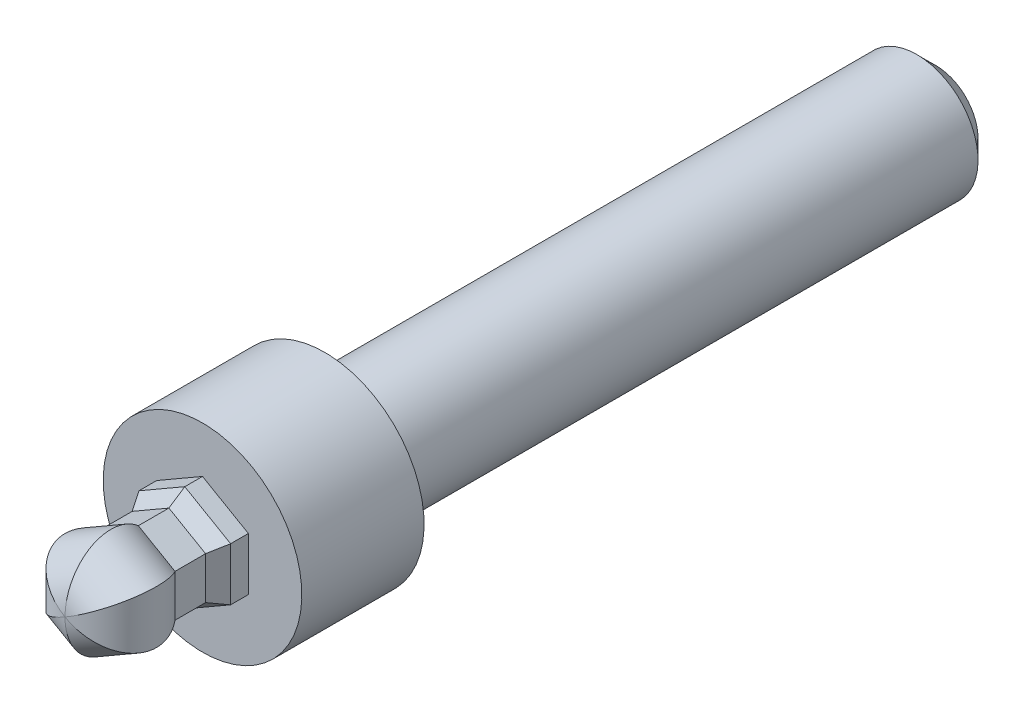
ISO-10303-21;
HEADER;
FILE_DESCRIPTION(('STEP AP214'),'2;1');
FILE_NAME('part.step','',(''),(''),'','','');
FILE_SCHEMA(('AUTOMOTIVE_DESIGN { 1 0 10303 214 1 1 1 1 }'));
ENDSEC;
DATA;
#1=APPLICATION_CONTEXT('core data for automotive mechanical design processes');
#2=APPLICATION_PROTOCOL_DEFINITION('international standard','automotive_design',2000,#1);
#3=PRODUCT_CONTEXT('',#1,'mechanical');
#4=PRODUCT('Part','Part','',(#3));
#5=PRODUCT_RELATED_PRODUCT_CATEGORY('part','',(#4));
#6=PRODUCT_DEFINITION_FORMATION('','',#4);
#7=PRODUCT_DEFINITION_CONTEXT('part definition',#1,'design');
#8=PRODUCT_DEFINITION('design','',#6,#7);
#9=PRODUCT_DEFINITION_SHAPE('','',#8);
#10=(LENGTH_UNIT() NAMED_UNIT(*) SI_UNIT(.MILLI.,.METRE.));
#11=(NAMED_UNIT(*) PLANE_ANGLE_UNIT() SI_UNIT($,.RADIAN.));
#12=(NAMED_UNIT(*) SI_UNIT($,.STERADIAN.) SOLID_ANGLE_UNIT());
#13=UNCERTAINTY_MEASURE_WITH_UNIT(LENGTH_MEASURE(1.E-05),#10,'distance_accuracy_value','');
#14=(GEOMETRIC_REPRESENTATION_CONTEXT(3) GLOBAL_UNCERTAINTY_ASSIGNED_CONTEXT((#13)) GLOBAL_UNIT_ASSIGNED_CONTEXT((#10,
#11,#12)) REPRESENTATION_CONTEXT('',''));
#15=CARTESIAN_POINT('',(0.,0.,0.));
#16=DIRECTION('',(0.,0.,1.));
#17=DIRECTION('',(1.,0.,0.));
#18=AXIS2_PLACEMENT_3D('',#15,#16,#17);
#19=CARTESIAN_POINT('',(0.,0.,-9.));
#20=DIRECTION('',(0.,0.,-1.));
#21=DIRECTION('',(-0.866025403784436,0.5,0.));
#22=AXIS2_PLACEMENT_3D('',#19,#20,#21);
#23=PLANE('',#22);
#24=CARTESIAN_POINT('',(0.,0.,-9.));
#25=DIRECTION('',(0.,0.,1.));
#26=DIRECTION('',(0.866025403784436,-0.5,0.));
#27=AXIS2_PLACEMENT_3D('',#24,#25,#26);
#28=CIRCLE('',#27,6.5);
#29=CARTESIAN_POINT('',(5.62916512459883,-3.25,-9.));
#30=VERTEX_POINT('',#29);
#31=EDGE_CURVE('E210',#30,#30,#28,.T.);
#32=ORIENTED_EDGE('',*,*,#31,.T.);
#33=EDGE_LOOP('',(#32));
#34=FACE_BOUND('',#33,.T.);
#35=DIRECTION('',(0.,-1.,0.));
#36=VECTOR('',#35,1.);
#37=CARTESIAN_POINT('',(-3.,0.,-9.));
#38=LINE('',#37,#36);
#39=CARTESIAN_POINT('',(-3.,1.73205080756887,-9.));
#40=VERTEX_POINT('',#39);
#41=CARTESIAN_POINT('',(-3.,-1.73205080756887,-9.));
#42=VERTEX_POINT('',#41);
#43=EDGE_CURVE('E29',#40,#42,#38,.T.);
#44=ORIENTED_EDGE('',*,*,#43,.F.);
#45=DIRECTION('',(-0.866025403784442,-0.5,0.));
#46=VECTOR('',#45,1.);
#47=CARTESIAN_POINT('',(-1.5,2.59807621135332,-9.));
#48=LINE('',#47,#46);
#49=CARTESIAN_POINT('',(0.,3.46410161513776,-9.));
#50=VERTEX_POINT('',#49);
#51=EDGE_CURVE('E223',#50,#40,#48,.T.);
#52=ORIENTED_EDGE('',*,*,#51,.F.);
#53=DIRECTION('',(-0.866025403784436,0.5,0.));
#54=VECTOR('',#53,1.);
#55=CARTESIAN_POINT('',(1.5,2.59807621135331,-9.));
#56=LINE('',#55,#54);
#57=CARTESIAN_POINT('',(3.,1.73205080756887,-9.));
#58=VERTEX_POINT('',#57);
#59=EDGE_CURVE('E37',#58,#50,#56,.T.);
#60=ORIENTED_EDGE('',*,*,#59,.F.);
#61=DIRECTION('',(0.,1.,0.));
#62=VECTOR('',#61,1.);
#63=CARTESIAN_POINT('',(3.,0.,-9.));
#64=LINE('',#63,#62);
#65=CARTESIAN_POINT('',(3.,-1.73205080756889,-9.));
#66=VERTEX_POINT('',#65);
#67=EDGE_CURVE('E213',#66,#58,#64,.T.);
#68=ORIENTED_EDGE('',*,*,#67,.F.);
#69=DIRECTION('',(0.866025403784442,0.5,0.));
#70=VECTOR('',#69,1.);
#71=CARTESIAN_POINT('',(1.5,-2.59807621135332,-9.));
#72=LINE('',#71,#70);
#73=CARTESIAN_POINT('',(0.,-3.46410161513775,-9.));
#74=VERTEX_POINT('',#73);
#75=EDGE_CURVE('E216',#74,#66,#72,.T.);
#76=ORIENTED_EDGE('',*,*,#75,.F.);
#77=DIRECTION('',(0.866025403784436,-0.5,0.));
#78=VECTOR('',#77,1.);
#79=CARTESIAN_POINT('',(-1.5,-2.59807621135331,-9.));
#80=LINE('',#79,#78);
#81=EDGE_CURVE('E219',#42,#74,#80,.T.);
#82=ORIENTED_EDGE('',*,*,#81,.F.);
#83=EDGE_LOOP('',(#44,#52,#60,#68,#76,#82));
#84=FACE_BOUND('',#83,.T.);
#85=ADVANCED_FACE('F14',(#34,#84),#23,.F.);
#86=CARTESIAN_POINT('',(0.,0.,-9.));
#87=DIRECTION('',(0.,0.,1.));
#88=DIRECTION('',(0.866025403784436,-0.5,0.));
#89=AXIS2_PLACEMENT_3D('',#86,#87,#88);
#90=CYLINDRICAL_SURFACE('',#89,6.5);
#91=ORIENTED_EDGE('',*,*,#31,.F.);
#92=EDGE_LOOP('',(#91));
#93=FACE_BOUND('',#92,.T.);
#94=CARTESIAN_POINT('',(0.,0.,-17.));
#95=DIRECTION('',(0.,0.,1.));
#96=DIRECTION('',(0.866025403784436,-0.5,0.));
#97=AXIS2_PLACEMENT_3D('',#94,#95,#96);
#98=CIRCLE('',#97,6.5);
#99=CARTESIAN_POINT('',(5.62916512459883,-3.25,-17.));
#100=VERTEX_POINT('',#99);
#101=EDGE_CURVE('E207',#100,#100,#98,.T.);
#102=ORIENTED_EDGE('',*,*,#101,.T.);
#103=EDGE_LOOP('',(#102));
#104=FACE_BOUND('',#103,.T.);
#105=ADVANCED_FACE('F264',(#93,#104),#90,.T.);
#106=CARTESIAN_POINT('',(-3.25000000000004,-5.62916512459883,-17.));
#107=DIRECTION('',(0.,0.,1.));
#108=DIRECTION('',(0.866025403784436,-0.5,0.));
#109=AXIS2_PLACEMENT_3D('',#106,#107,#108);
#110=PLANE('',#109);
#111=ORIENTED_EDGE('',*,*,#101,.F.);
#112=EDGE_LOOP('',(#111));
#113=FACE_BOUND('',#112,.T.);
#114=CARTESIAN_POINT('',(0.,0.,-17.));
#115=DIRECTION('',(0.,0.,1.));
#116=DIRECTION('',(0.866025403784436,-0.5,0.));
#117=AXIS2_PLACEMENT_3D('',#114,#115,#116);
#118=CIRCLE('',#117,4.);
#119=CARTESIAN_POINT('',(3.46410161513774,-2.,-17.));
#120=VERTEX_POINT('',#119);
#121=EDGE_CURVE('E204',#120,#120,#118,.T.);
#122=ORIENTED_EDGE('',*,*,#121,.T.);
#123=EDGE_LOOP('',(#122));
#124=FACE_BOUND('',#123,.T.);
#125=ADVANCED_FACE('F261',(#113,#124),#110,.F.);
#126=CARTESIAN_POINT('',(0.,0.,-9.));
#127=DIRECTION('',(0.,0.,1.));
#128=DIRECTION('',(0.866025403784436,-0.5,0.));
#129=AXIS2_PLACEMENT_3D('',#126,#127,#128);
#130=CYLINDRICAL_SURFACE('',#129,4.);
#131=CARTESIAN_POINT('',(0.,0.,-55.75));
#132=DIRECTION('',(0.,0.,1.));
#133=DIRECTION('',(0.866025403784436,-0.5,0.));
#134=AXIS2_PLACEMENT_3D('',#131,#132,#133);
#135=CIRCLE('',#134,4.);
#136=CARTESIAN_POINT('',(3.46410161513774,-2.,-55.75));
#137=VERTEX_POINT('',#136);
#138=EDGE_CURVE('E22',#137,#137,#135,.T.);
#139=ORIENTED_EDGE('',*,*,#138,.T.);
#140=EDGE_LOOP('',(#139));
#141=FACE_BOUND('',#140,.T.);
#142=ORIENTED_EDGE('',*,*,#121,.F.);
#143=EDGE_LOOP('',(#142));
#144=FACE_BOUND('',#143,.T.);
#145=ADVANCED_FACE('F228',(#141,#144),#130,.T.);
#146=CARTESIAN_POINT('',(-2.00000000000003,-3.46410161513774,-57.));
#147=DIRECTION('',(0.,0.,1.));
#148=DIRECTION('',(0.866025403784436,-0.5,0.));
#149=AXIS2_PLACEMENT_3D('',#146,#147,#148);
#150=PLANE('',#149);
#151=CARTESIAN_POINT('',(0.,0.,-57.));
#152=DIRECTION('',(0.,0.,1.));
#153=DIRECTION('',(0.866025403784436,-0.5,0.));
#154=AXIS2_PLACEMENT_3D('',#151,#152,#153);
#155=CIRCLE('',#154,2.75);
#156=CARTESIAN_POINT('',(2.38156986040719,-1.375,-57.));
#157=VERTEX_POINT('',#156);
#158=EDGE_CURVE('E9',#157,#157,#155,.F.);
#159=ORIENTED_EDGE('',*,*,#158,.T.);
#160=EDGE_LOOP('',(#159));
#161=FACE_BOUND('',#160,.T.);
#162=ADVANCED_FACE('F234',(#161),#150,.F.);
#163=CARTESIAN_POINT('',(21.6506350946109,-12.5000000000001,-3.));
#164=DIRECTION('',(-0.866025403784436,0.5,0.));
#165=DIRECTION('',(0.,0.,1.));
#166=AXIS2_PLACEMENT_3D('',#163,#164,#165);
#167=CYLINDRICAL_SURFACE('',#166,3.);
#168=DIRECTION('',(-0.866025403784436,0.5,0.));
#169=VECTOR('',#168,1.);
#170=CARTESIAN_POINT('',(22.8506350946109,-10.4215390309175,-4.8));
#171=LINE('',#170,#169);
#172=CARTESIAN_POINT('',(2.4,1.38564064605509,-4.8));
#173=VERTEX_POINT('',#172);
#174=CARTESIAN_POINT('',(0.,2.77128129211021,-4.8));
#175=VERTEX_POINT('',#174);
#176=EDGE_CURVE('E170',#173,#175,#171,.T.);
#177=ORIENTED_EDGE('',*,*,#176,.T.);
#178=CARTESIAN_POINT('',(0.,0.,-3.));
#179=DIRECTION('',(-1.,0.,0.));
#180=DIRECTION('',(0.,1.,0.));
#181=AXIS2_PLACEMENT_3D('',#178,#179,#180);
#182=ELLIPSE('',#181,3.46410161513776,3.);
#183=CARTESIAN_POINT('',(0.,0.,0.));
#184=VERTEX_POINT('',#183);
#185=EDGE_CURVE('E191',#175,#184,#182,.F.);
#186=ORIENTED_EDGE('',*,*,#185,.T.);
#187=CARTESIAN_POINT('',(0.,0.,-3.));
#188=DIRECTION('',(-0.5,0.866025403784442,0.));
#189=DIRECTION('',(-0.866025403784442,-0.5,0.));
#190=AXIS2_PLACEMENT_3D('',#187,#188,#189);
#191=ELLIPSE('',#190,3.46410161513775,3.);
#192=EDGE_CURVE('E134',#184,#173,#191,.T.);
#193=ORIENTED_EDGE('',*,*,#192,.T.);
#194=EDGE_LOOP('',(#177,#186,#193));
#195=FACE_BOUND('',#194,.T.);
#196=ADVANCED_FACE('F243',(#195),#167,.T.);
#197=DIRECTION('',(-0.866025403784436,0.5,0.));
#198=VECTOR('',#197,1.);
#199=CARTESIAN_POINT('',(20.4506350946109,-14.5784609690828,-4.8));
#200=LINE('',#199,#198);
#201=CARTESIAN_POINT('',(0.,-2.77128129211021,-4.8));
#202=VERTEX_POINT('',#201);
#203=CARTESIAN_POINT('',(-2.4,-1.38564064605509,-4.8));
#204=VERTEX_POINT('',#203);
#205=EDGE_CURVE('E169',#202,#204,#200,.T.);
#206=ORIENTED_EDGE('',*,*,#205,.F.);
#207=CARTESIAN_POINT('',(0.,0.,-3.));
#208=DIRECTION('',(-1.,0.,0.));
#209=DIRECTION('',(0.,1.,0.));
#210=AXIS2_PLACEMENT_3D('',#207,#208,#209);
#211=ELLIPSE('',#210,3.46410161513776,3.);
#212=EDGE_CURVE('E127',#202,#184,#211,.T.);
#213=ORIENTED_EDGE('',*,*,#212,.T.);
#214=CARTESIAN_POINT('',(0.,0.,-3.));
#215=DIRECTION('',(-0.5,0.866025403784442,0.));
#216=DIRECTION('',(-0.866025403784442,-0.5,0.));
#217=AXIS2_PLACEMENT_3D('',#214,#215,#216);
#218=ELLIPSE('',#217,3.46410161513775,3.);
#219=EDGE_CURVE('E173',#184,#204,#218,.F.);
#220=ORIENTED_EDGE('',*,*,#219,.T.);
#221=EDGE_LOOP('',(#206,#213,#220));
#222=FACE_BOUND('',#221,.T.);
#223=ADVANCED_FACE('F247',(#222),#167,.T.);
#224=CARTESIAN_POINT('',(1.02348685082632E-13,25.,-3.));
#225=DIRECTION('',(0.,-1.,0.));
#226=DIRECTION('',(-1.,0.,0.));
#227=AXIS2_PLACEMENT_3D('',#224,#225,#226);
#228=CYLINDRICAL_SURFACE('',#227,3.);
#229=CARTESIAN_POINT('',(0.,0.,-3.));
#230=DIRECTION('',(-0.5,-0.866025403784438,0.));
#231=DIRECTION('',(-0.866025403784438,0.5,0.));
#232=AXIS2_PLACEMENT_3D('',#229,#230,#231);
#233=ELLIPSE('',#232,3.46410161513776,3.);
#234=CARTESIAN_POINT('',(-2.4,1.3856406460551,-4.8));
#235=VERTEX_POINT('',#234);
#236=EDGE_CURVE('E136',#235,#184,#233,.F.);
#237=ORIENTED_EDGE('',*,*,#236,.F.);
#238=DIRECTION('',(0.,-1.,0.));
#239=VECTOR('',#238,1.);
#240=CARTESIAN_POINT('',(-2.39999999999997,25.,-4.8));
#241=LINE('',#240,#239);
#242=EDGE_CURVE('E539',#235,#204,#241,.T.);
#243=ORIENTED_EDGE('',*,*,#242,.T.);
#244=ORIENTED_EDGE('',*,*,#219,.F.);
#245=EDGE_LOOP('',(#237,#243,#244));
#246=FACE_BOUND('',#245,.T.);
#247=ADVANCED_FACE('F253',(#246),#228,.T.);
#248=CARTESIAN_POINT('',(21.6506350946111,12.5,-3.));
#249=DIRECTION('',(-0.866025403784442,-0.5,0.));
#250=DIRECTION('',(-0.5,0.866025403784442,0.));
#251=AXIS2_PLACEMENT_3D('',#248,#249,#250);
#252=CYLINDRICAL_SURFACE('',#251,3.);
#253=DIRECTION('',(-0.866025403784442,-0.5,0.));
#254=VECTOR('',#253,1.);
#255=CARTESIAN_POINT('',(20.450635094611,14.5784609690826,-4.8));
#256=LINE('',#255,#254);
#257=EDGE_CURVE('E143',#175,#235,#256,.T.);
#258=ORIENTED_EDGE('',*,*,#257,.T.);
#259=ORIENTED_EDGE('',*,*,#236,.T.);
#260=ORIENTED_EDGE('',*,*,#185,.F.);
#261=EDGE_LOOP('',(#258,#259,#260));
#262=FACE_BOUND('',#261,.T.);
#263=ADVANCED_FACE('F317',(#262),#252,.T.);
#264=DIRECTION('',(-0.866025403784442,-0.5,0.));
#265=VECTOR('',#264,1.);
#266=CARTESIAN_POINT('',(22.850635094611,10.4215390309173,-4.8));
#267=LINE('',#266,#265);
#268=CARTESIAN_POINT('',(2.4,-1.38564064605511,-4.8));
#269=VERTEX_POINT('',#268);
#270=EDGE_CURVE('E123',#269,#202,#267,.T.);
#271=ORIENTED_EDGE('',*,*,#270,.F.);
#272=CARTESIAN_POINT('',(0.,0.,-3.));
#273=DIRECTION('',(-0.5,-0.866025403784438,0.));
#274=DIRECTION('',(-0.866025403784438,0.5,0.));
#275=AXIS2_PLACEMENT_3D('',#272,#273,#274);
#276=ELLIPSE('',#275,3.46410161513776,3.);
#277=EDGE_CURVE('E125',#269,#184,#276,.T.);
#278=ORIENTED_EDGE('',*,*,#277,.T.);
#279=ORIENTED_EDGE('',*,*,#212,.F.);
#280=EDGE_LOOP('',(#271,#278,#279));
#281=FACE_BOUND('',#280,.T.);
#282=ADVANCED_FACE('F124',(#281),#252,.T.);
#283=ORIENTED_EDGE('',*,*,#277,.F.);
#284=DIRECTION('',(0.,-1.,0.));
#285=VECTOR('',#284,1.);
#286=CARTESIAN_POINT('',(2.40000000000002,25.,-4.8));
#287=LINE('',#286,#285);
#288=EDGE_CURVE('E106',#173,#269,#287,.T.);
#289=ORIENTED_EDGE('',*,*,#288,.F.);
#290=ORIENTED_EDGE('',*,*,#192,.F.);
#291=EDGE_LOOP('',(#283,#289,#290));
#292=FACE_BOUND('',#291,.T.);
#293=ADVANCED_FACE('F133',(#292),#228,.T.);
#294=CARTESIAN_POINT('',(22.8506350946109,-10.4215390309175,-4.8));
#295=DIRECTION('',(-0.5,-0.866025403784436,0.));
#296=DIRECTION('',(0.,0.,1.));
#297=AXIS2_PLACEMENT_3D('',#294,#295,#296);
#298=PLANE('',#297);
#299=DIRECTION('',(-0.866025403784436,0.5,0.));
#300=VECTOR('',#299,1.);
#301=CARTESIAN_POINT('',(22.8506350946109,-10.4215390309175,-6.8));
#302=LINE('',#301,#300);
#303=CARTESIAN_POINT('',(2.4,1.38564064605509,-6.8));
#304=VERTEX_POINT('',#303);
#305=CARTESIAN_POINT('',(0.,2.77128129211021,-6.8));
#306=VERTEX_POINT('',#305);
#307=EDGE_CURVE('E174',#304,#306,#302,.T.);
#308=ORIENTED_EDGE('',*,*,#307,.T.);
#309=DIRECTION('',(0.,0.,1.));
#310=VECTOR('',#309,1.);
#311=CARTESIAN_POINT('',(0.,2.77128129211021,-4.8));
#312=LINE('',#311,#310);
#313=EDGE_CURVE('E154',#306,#175,#312,.T.);
#314=ORIENTED_EDGE('',*,*,#313,.T.);
#315=ORIENTED_EDGE('',*,*,#176,.F.);
#316=DIRECTION('',(0.,0.,-1.));
#317=VECTOR('',#316,1.);
#318=CARTESIAN_POINT('',(2.4,1.38564064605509,-4.8));
#319=LINE('',#318,#317);
#320=EDGE_CURVE('E114',#173,#304,#319,.T.);
#321=ORIENTED_EDGE('',*,*,#320,.T.);
#322=EDGE_LOOP('',(#308,#314,#315,#321));
#323=FACE_BOUND('',#322,.T.);
#324=ADVANCED_FACE('F343',(#323),#298,.F.);
#325=CARTESIAN_POINT('',(20.4506350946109,-14.5784609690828,-4.8));
#326=DIRECTION('',(0.5,0.866025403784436,0.));
#327=DIRECTION('',(0.,0.,-1.));
#328=AXIS2_PLACEMENT_3D('',#325,#326,#327);
#329=PLANE('',#328);
#330=DIRECTION('',(-0.866025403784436,0.5,0.));
#331=VECTOR('',#330,1.);
#332=CARTESIAN_POINT('',(20.4506350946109,-14.5784609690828,-6.8));
#333=LINE('',#332,#331);
#334=CARTESIAN_POINT('',(0.,-2.77128129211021,-6.8));
#335=VERTEX_POINT('',#334);
#336=CARTESIAN_POINT('',(-2.4,-1.38564064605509,-6.8));
#337=VERTEX_POINT('',#336);
#338=EDGE_CURVE('E183',#335,#337,#333,.T.);
#339=ORIENTED_EDGE('',*,*,#338,.F.);
#340=DIRECTION('',(0.,0.,1.));
#341=VECTOR('',#340,1.);
#342=CARTESIAN_POINT('',(0.,-2.77128129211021,-4.8));
#343=LINE('',#342,#341);
#344=EDGE_CURVE('E152',#335,#202,#343,.T.);
#345=ORIENTED_EDGE('',*,*,#344,.T.);
#346=ORIENTED_EDGE('',*,*,#205,.T.);
#347=DIRECTION('',(0.,0.,-1.));
#348=VECTOR('',#347,1.);
#349=CARTESIAN_POINT('',(-2.4,-1.38564064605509,-4.8));
#350=LINE('',#349,#348);
#351=EDGE_CURVE('E142',#204,#337,#350,.T.);
#352=ORIENTED_EDGE('',*,*,#351,.T.);
#353=EDGE_LOOP('',(#339,#345,#346,#352));
#354=FACE_BOUND('',#353,.T.);
#355=ADVANCED_FACE('F256',(#354),#329,.F.);
#356=CARTESIAN_POINT('',(-2.39999999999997,25.,-4.8));
#357=DIRECTION('',(1.,0.,0.));
#358=DIRECTION('',(0.,-1.,0.));
#359=AXIS2_PLACEMENT_3D('',#356,#357,#358);
#360=PLANE('',#359);
#361=ORIENTED_EDGE('',*,*,#242,.F.);
#362=DIRECTION('',(0.,0.,1.));
#363=VECTOR('',#362,1.);
#364=CARTESIAN_POINT('',(-2.4,1.38564064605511,-4.8));
#365=LINE('',#364,#363);
#366=CARTESIAN_POINT('',(-2.4,1.38564064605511,-6.8));
#367=VERTEX_POINT('',#366);
#368=EDGE_CURVE('E137',#367,#235,#365,.T.);
#369=ORIENTED_EDGE('',*,*,#368,.F.);
#370=DIRECTION('',(0.,-1.,0.));
#371=VECTOR('',#370,1.);
#372=CARTESIAN_POINT('',(-2.39999999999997,25.,-6.8));
#373=LINE('',#372,#371);
#374=EDGE_CURVE('E530',#367,#337,#373,.T.);
#375=ORIENTED_EDGE('',*,*,#374,.T.);
#376=ORIENTED_EDGE('',*,*,#351,.F.);
#377=EDGE_LOOP('',(#361,#369,#375,#376));
#378=FACE_BOUND('',#377,.T.);
#379=ADVANCED_FACE('F360',(#378),#360,.F.);
#380=CARTESIAN_POINT('',(20.450635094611,14.5784609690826,-4.8));
#381=DIRECTION('',(0.5,-0.866025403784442,0.));
#382=DIRECTION('',(-0.866025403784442,-0.5,0.));
#383=AXIS2_PLACEMENT_3D('',#380,#381,#382);
#384=PLANE('',#383);
#385=DIRECTION('',(-0.866025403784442,-0.5,0.));
#386=VECTOR('',#385,1.);
#387=CARTESIAN_POINT('',(20.450635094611,14.5784609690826,-6.8));
#388=LINE('',#387,#386);
#389=EDGE_CURVE('E147',#306,#367,#388,.T.);
#390=ORIENTED_EDGE('',*,*,#389,.T.);
#391=ORIENTED_EDGE('',*,*,#368,.T.);
#392=ORIENTED_EDGE('',*,*,#257,.F.);
#393=ORIENTED_EDGE('',*,*,#313,.F.);
#394=EDGE_LOOP('',(#390,#391,#392,#393));
#395=FACE_BOUND('',#394,.T.);
#396=ADVANCED_FACE('F369',(#395),#384,.F.);
#397=CARTESIAN_POINT('',(22.850635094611,10.4215390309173,-4.8));
#398=DIRECTION('',(-0.5,0.866025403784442,0.));
#399=DIRECTION('',(0.866025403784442,0.5,0.));
#400=AXIS2_PLACEMENT_3D('',#397,#398,#399);
#401=PLANE('',#400);
#402=DIRECTION('',(-0.866025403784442,-0.5,0.));
#403=VECTOR('',#402,1.);
#404=CARTESIAN_POINT('',(22.850635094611,10.4215390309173,-6.8));
#405=LINE('',#404,#403);
#406=CARTESIAN_POINT('',(2.4,-1.38564064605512,-6.8));
#407=VERTEX_POINT('',#406);
#408=EDGE_CURVE('E130',#407,#335,#405,.T.);
#409=ORIENTED_EDGE('',*,*,#408,.F.);
#410=DIRECTION('',(0.,0.,1.));
#411=VECTOR('',#410,1.);
#412=CARTESIAN_POINT('',(2.4,-1.38564064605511,-4.8));
#413=LINE('',#412,#411);
#414=EDGE_CURVE('E111',#407,#269,#413,.T.);
#415=ORIENTED_EDGE('',*,*,#414,.T.);
#416=ORIENTED_EDGE('',*,*,#270,.T.);
#417=ORIENTED_EDGE('',*,*,#344,.F.);
#418=EDGE_LOOP('',(#409,#415,#416,#417));
#419=FACE_BOUND('',#418,.T.);
#420=ADVANCED_FACE('F139',(#419),#401,.F.);
#421=CARTESIAN_POINT('',(2.40000000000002,25.,-4.8));
#422=DIRECTION('',(-1.,0.,0.));
#423=DIRECTION('',(0.,1.,0.));
#424=AXIS2_PLACEMENT_3D('',#421,#422,#423);
#425=PLANE('',#424);
#426=ORIENTED_EDGE('',*,*,#288,.T.);
#427=ORIENTED_EDGE('',*,*,#414,.F.);
#428=DIRECTION('',(0.,-1.,0.));
#429=VECTOR('',#428,1.);
#430=CARTESIAN_POINT('',(2.40000000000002,25.,-6.8));
#431=LINE('',#430,#429);
#432=EDGE_CURVE('E119',#304,#407,#431,.T.);
#433=ORIENTED_EDGE('',*,*,#432,.F.);
#434=ORIENTED_EDGE('',*,*,#320,.F.);
#435=EDGE_LOOP('',(#426,#427,#433,#434));
#436=FACE_BOUND('',#435,.T.);
#437=ADVANCED_FACE('F108',(#436),#425,.F.);
#438=CARTESIAN_POINT('',(22.8506350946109,-10.4215390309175,-6.8));
#439=DIRECTION('',(-0.433012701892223,-0.75,-0.5));
#440=DIRECTION('',(-0.25,-0.433012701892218,0.866025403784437));
#441=AXIS2_PLACEMENT_3D('',#438,#439,#440);
#442=PLANE('',#441);
#443=DIRECTION('',(-0.866025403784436,0.5,0.));
#444=VECTOR('',#443,1.);
#445=CARTESIAN_POINT('',(23.1506350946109,-9.90192378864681,-7.83923048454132));
#446=LINE('',#445,#444);
#447=CARTESIAN_POINT('',(3.,1.73205080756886,-7.83923048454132));
#448=VERTEX_POINT('',#447);
#449=CARTESIAN_POINT('',(0.,3.46410161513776,-7.83923048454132));
#450=VERTEX_POINT('',#449);
#451=EDGE_CURVE('E177',#448,#450,#446,.T.);
#452=ORIENTED_EDGE('',*,*,#451,.T.);
#453=DIRECTION('',(0.,-0.554700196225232,0.832050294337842));
#454=VECTOR('',#453,1.);
#455=CARTESIAN_POINT('',(0.,-1.28804803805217,-0.711006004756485));
#456=LINE('',#455,#454);
#457=EDGE_CURVE('E166',#450,#306,#456,.T.);
#458=ORIENTED_EDGE('',*,*,#457,.T.);
#459=ORIENTED_EDGE('',*,*,#307,.F.);
#460=DIRECTION('',(0.480384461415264,0.277350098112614,-0.832050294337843));
#461=VECTOR('',#460,1.);
#462=CARTESIAN_POINT('',(5.54625155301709,3.20212982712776,-12.249467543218));
#463=LINE('',#462,#461);
#464=EDGE_CURVE('E163',#304,#448,#463,.T.);
#465=ORIENTED_EDGE('',*,*,#464,.T.);
#466=EDGE_LOOP('',(#452,#458,#459,#465));
#467=FACE_BOUND('',#466,.T.);
#468=ADVANCED_FACE('F396',(#467),#442,.F.);
#469=CARTESIAN_POINT('',(20.4506350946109,-14.5784609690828,-6.8));
#470=DIRECTION('',(0.433012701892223,0.75,-0.5));
#471=DIRECTION('',(-0.25,-0.433012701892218,-0.866025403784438));
#472=AXIS2_PLACEMENT_3D('',#469,#470,#471);
#473=PLANE('',#472);
#474=DIRECTION('',(-0.866025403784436,0.5,0.));
#475=VECTOR('',#474,1.);
#476=CARTESIAN_POINT('',(20.1506350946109,-15.0980762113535,-7.83923048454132));
#477=LINE('',#476,#475);
#478=CARTESIAN_POINT('',(0.,-3.46410161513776,-7.83923048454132));
#479=VERTEX_POINT('',#478);
#480=CARTESIAN_POINT('',(-3.,-1.73205080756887,-7.83923048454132));
#481=VERTEX_POINT('',#480);
#482=EDGE_CURVE('E180',#479,#481,#477,.T.);
#483=ORIENTED_EDGE('',*,*,#482,.F.);
#484=DIRECTION('',(0.,0.554700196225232,0.832050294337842));
#485=VECTOR('',#484,1.);
#486=CARTESIAN_POINT('',(0.,-6.40425965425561,-12.2494675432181));
#487=LINE('',#486,#485);
#488=EDGE_CURVE('E160',#479,#335,#487,.T.);
#489=ORIENTED_EDGE('',*,*,#488,.T.);
#490=ORIENTED_EDGE('',*,*,#338,.T.);
#491=DIRECTION('',(-0.480384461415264,-0.277350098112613,-0.832050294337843));
#492=VECTOR('',#491,1.);
#493=CARTESIAN_POINT('',(1.11548232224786,0.644024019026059,-0.711006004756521));
#494=LINE('',#493,#492);
#495=EDGE_CURVE('E157',#337,#481,#494,.T.);
#496=ORIENTED_EDGE('',*,*,#495,.T.);
#497=EDGE_LOOP('',(#483,#489,#490,#496));
#498=FACE_BOUND('',#497,.T.);
#499=ADVANCED_FACE('F405',(#498),#473,.F.);
#500=CARTESIAN_POINT('',(-2.39999999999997,25.,-6.8));
#501=DIRECTION('',(0.86602540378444,0.,-0.5));
#502=DIRECTION('',(-0.480384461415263,0.277350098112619,-0.832050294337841));
#503=AXIS2_PLACEMENT_3D('',#500,#501,#502);
#504=PLANE('',#503);
#505=ORIENTED_EDGE('',*,*,#374,.F.);
#506=DIRECTION('',(0.480384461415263,-0.277350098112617,0.832050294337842));
#507=VECTOR('',#506,1.);
#508=CARTESIAN_POINT('',(1.11548232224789,-0.644024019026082,-0.711006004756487));
#509=LINE('',#508,#507);
#510=CARTESIAN_POINT('',(-3.,1.73205080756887,-7.83923048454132));
#511=VERTEX_POINT('',#510);
#512=EDGE_CURVE('E529',#511,#367,#509,.T.);
#513=ORIENTED_EDGE('',*,*,#512,.F.);
#514=DIRECTION('',(0.,-1.,0.));
#515=VECTOR('',#514,1.);
#516=CARTESIAN_POINT('',(-3.,25.,-7.83923048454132));
#517=LINE('',#516,#515);
#518=EDGE_CURVE('E524',#511,#481,#517,.T.);
#519=ORIENTED_EDGE('',*,*,#518,.T.);
#520=ORIENTED_EDGE('',*,*,#495,.F.);
#521=EDGE_LOOP('',(#505,#513,#519,#520));
#522=FACE_BOUND('',#521,.T.);
#523=ADVANCED_FACE('F415',(#522),#504,.F.);
#524=CARTESIAN_POINT('',(20.450635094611,14.5784609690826,-6.8));
#525=DIRECTION('',(0.433012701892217,-0.75,-0.5));
#526=DIRECTION('',(-0.480384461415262,0.277350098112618,-0.832050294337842));
#527=AXIS2_PLACEMENT_3D('',#524,#525,#526);
#528=PLANE('',#527);
#529=DIRECTION('',(-0.866025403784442,-0.5,0.));
#530=VECTOR('',#529,1.);
#531=CARTESIAN_POINT('',(20.150635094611,15.0980762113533,-7.83923048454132));
#532=LINE('',#531,#530);
#533=EDGE_CURVE('E551',#450,#511,#532,.T.);
#534=ORIENTED_EDGE('',*,*,#533,.T.);
#535=ORIENTED_EDGE('',*,*,#512,.T.);
#536=ORIENTED_EDGE('',*,*,#389,.F.);
#537=ORIENTED_EDGE('',*,*,#457,.F.);
#538=EDGE_LOOP('',(#534,#535,#536,#537));
#539=FACE_BOUND('',#538,.T.);
#540=ADVANCED_FACE('F424',(#539),#528,.F.);
#541=CARTESIAN_POINT('',(22.850635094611,10.4215390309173,-6.8));
#542=DIRECTION('',(-0.433012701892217,0.75,-0.5));
#543=DIRECTION('',(-0.480384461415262,0.277350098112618,0.832050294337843));
#544=AXIS2_PLACEMENT_3D('',#541,#542,#543);
#545=PLANE('',#544);
#546=DIRECTION('',(-0.866025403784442,-0.5,0.));
#547=VECTOR('',#546,1.);
#548=CARTESIAN_POINT('',(23.150635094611,9.90192378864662,-7.83923048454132));
#549=LINE('',#548,#547);
#550=CARTESIAN_POINT('',(3.,-1.73205080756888,-7.83923048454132));
#551=VERTEX_POINT('',#550);
#552=EDGE_CURVE('E554',#551,#479,#549,.T.);
#553=ORIENTED_EDGE('',*,*,#552,.F.);
#554=DIRECTION('',(-0.480384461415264,0.277350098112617,0.832050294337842));
#555=VECTOR('',#554,1.);
#556=CARTESIAN_POINT('',(5.54625155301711,-3.20212982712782,-12.2494675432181));
#557=LINE('',#556,#555);
#558=EDGE_CURVE('E558',#551,#407,#557,.T.);
#559=ORIENTED_EDGE('',*,*,#558,.T.);
#560=ORIENTED_EDGE('',*,*,#408,.T.);
#561=ORIENTED_EDGE('',*,*,#488,.F.);
#562=EDGE_LOOP('',(#553,#559,#560,#561));
#563=FACE_BOUND('',#562,.T.);
#564=ADVANCED_FACE('F434',(#563),#545,.F.);
#565=CARTESIAN_POINT('',(2.40000000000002,25.,-6.8));
#566=DIRECTION('',(-0.86602540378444,0.,-0.5));
#567=DIRECTION('',(-0.480384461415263,0.277350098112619,0.832050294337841));
#568=AXIS2_PLACEMENT_3D('',#565,#566,#567);
#569=PLANE('',#568);
#570=ORIENTED_EDGE('',*,*,#432,.T.);
#571=ORIENTED_EDGE('',*,*,#558,.F.);
#572=DIRECTION('',(0.,-1.,0.));
#573=VECTOR('',#572,1.);
#574=CARTESIAN_POINT('',(3.,25.,-7.83923048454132));
#575=LINE('',#574,#573);
#576=EDGE_CURVE('E531',#448,#551,#575,.T.);
#577=ORIENTED_EDGE('',*,*,#576,.F.);
#578=ORIENTED_EDGE('',*,*,#464,.F.);
#579=EDGE_LOOP('',(#570,#571,#577,#578));
#580=FACE_BOUND('',#579,.T.);
#581=ADVANCED_FACE('F444',(#580),#569,.F.);
#582=CARTESIAN_POINT('',(3.,25.,-7.83923048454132));
#583=DIRECTION('',(-1.,0.,0.));
#584=DIRECTION('',(0.,1.,0.));
#585=AXIS2_PLACEMENT_3D('',#582,#583,#584);
#586=PLANE('',#585);
#587=DIRECTION('',(0.,0.,1.));
#588=VECTOR('',#587,1.);
#589=CARTESIAN_POINT('',(3.,-1.73205080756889,-7.83923048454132));
#590=LINE('',#589,#588);
#591=EDGE_CURVE('E544',#66,#551,#590,.T.);
#592=ORIENTED_EDGE('',*,*,#591,.F.);
#593=ORIENTED_EDGE('',*,*,#67,.T.);
#594=DIRECTION('',(0.,0.,-1.));
#595=VECTOR('',#594,1.);
#596=CARTESIAN_POINT('',(3.,1.73205080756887,-7.83923048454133));
#597=LINE('',#596,#595);
#598=EDGE_CURVE('E200',#448,#58,#597,.T.);
#599=ORIENTED_EDGE('',*,*,#598,.F.);
#600=ORIENTED_EDGE('',*,*,#576,.T.);
#601=EDGE_LOOP('',(#592,#593,#599,#600));
#602=FACE_BOUND('',#601,.T.);
#603=ADVANCED_FACE('F454',(#602),#586,.F.);
#604=CARTESIAN_POINT('',(23.150635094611,9.90192378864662,-7.83923048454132));
#605=DIRECTION('',(-0.5,0.866025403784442,0.));
#606=DIRECTION('',(0.866025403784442,0.5,0.));
#607=AXIS2_PLACEMENT_3D('',#604,#605,#606);
#608=PLANE('',#607);
#609=DIRECTION('',(0.,0.,1.));
#610=VECTOR('',#609,1.);
#611=CARTESIAN_POINT('',(0.,-3.46410161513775,-7.83923048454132));
#612=LINE('',#611,#610);
#613=EDGE_CURVE('E198',#74,#479,#612,.T.);
#614=ORIENTED_EDGE('',*,*,#613,.F.);
#615=ORIENTED_EDGE('',*,*,#75,.T.);
#616=ORIENTED_EDGE('',*,*,#591,.T.);
#617=ORIENTED_EDGE('',*,*,#552,.T.);
#618=EDGE_LOOP('',(#614,#615,#616,#617));
#619=FACE_BOUND('',#618,.T.);
#620=ADVANCED_FACE('F464',(#619),#608,.F.);
#621=CARTESIAN_POINT('',(20.150635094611,15.0980762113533,-7.83923048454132));
#622=DIRECTION('',(0.5,-0.866025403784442,0.));
#623=DIRECTION('',(-0.866025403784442,-0.5,0.));
#624=AXIS2_PLACEMENT_3D('',#621,#622,#623);
#625=PLANE('',#624);
#626=DIRECTION('',(0.,0.,1.));
#627=VECTOR('',#626,1.);
#628=CARTESIAN_POINT('',(0.,3.46410161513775,-7.83923048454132));
#629=LINE('',#628,#627);
#630=EDGE_CURVE('E202',#50,#450,#629,.T.);
#631=ORIENTED_EDGE('',*,*,#630,.F.);
#632=ORIENTED_EDGE('',*,*,#51,.T.);
#633=DIRECTION('',(0.,0.,1.));
#634=VECTOR('',#633,1.);
#635=CARTESIAN_POINT('',(-3.,1.73205080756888,-7.83923048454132));
#636=LINE('',#635,#634);
#637=EDGE_CURVE('E131',#40,#511,#636,.T.);
#638=ORIENTED_EDGE('',*,*,#637,.T.);
#639=ORIENTED_EDGE('',*,*,#533,.F.);
#640=EDGE_LOOP('',(#631,#632,#638,#639));
#641=FACE_BOUND('',#640,.T.);
#642=ADVANCED_FACE('F474',(#641),#625,.F.);
#643=CARTESIAN_POINT('',(-3.,25.,-7.83923048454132));
#644=DIRECTION('',(1.,0.,0.));
#645=DIRECTION('',(0.,-1.,0.));
#646=AXIS2_PLACEMENT_3D('',#643,#644,#645);
#647=PLANE('',#646);
#648=ORIENTED_EDGE('',*,*,#637,.F.);
#649=ORIENTED_EDGE('',*,*,#43,.T.);
#650=DIRECTION('',(0.,0.,-1.));
#651=VECTOR('',#650,1.);
#652=CARTESIAN_POINT('',(-3.,-1.73205080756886,-7.83923048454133));
#653=LINE('',#652,#651);
#654=EDGE_CURVE('E195',#481,#42,#653,.T.);
#655=ORIENTED_EDGE('',*,*,#654,.F.);
#656=ORIENTED_EDGE('',*,*,#518,.F.);
#657=EDGE_LOOP('',(#648,#649,#655,#656));
#658=FACE_BOUND('',#657,.T.);
#659=ADVANCED_FACE('F484',(#658),#647,.F.);
#660=CARTESIAN_POINT('',(20.1506350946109,-15.0980762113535,-7.83923048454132));
#661=DIRECTION('',(0.5,0.866025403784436,0.));
#662=DIRECTION('',(0.,0.,-1.));
#663=AXIS2_PLACEMENT_3D('',#660,#661,#662);
#664=PLANE('',#663);
#665=ORIENTED_EDGE('',*,*,#654,.T.);
#666=ORIENTED_EDGE('',*,*,#81,.T.);
#667=ORIENTED_EDGE('',*,*,#613,.T.);
#668=ORIENTED_EDGE('',*,*,#482,.T.);
#669=EDGE_LOOP('',(#665,#666,#667,#668));
#670=FACE_BOUND('',#669,.T.);
#671=ADVANCED_FACE('F239',(#670),#664,.F.);
#672=CARTESIAN_POINT('',(23.1506350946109,-9.90192378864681,-7.83923048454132));
#673=DIRECTION('',(-0.5,-0.866025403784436,0.));
#674=DIRECTION('',(0.,0.,1.));
#675=AXIS2_PLACEMENT_3D('',#672,#673,#674);
#676=PLANE('',#675);
#677=ORIENTED_EDGE('',*,*,#598,.T.);
#678=ORIENTED_EDGE('',*,*,#59,.T.);
#679=ORIENTED_EDGE('',*,*,#630,.T.);
#680=ORIENTED_EDGE('',*,*,#451,.F.);
#681=EDGE_LOOP('',(#677,#678,#679,#680));
#682=FACE_BOUND('',#681,.T.);
#683=ADVANCED_FACE('F232',(#682),#676,.F.);
#684=CARTESIAN_POINT('',(0.,0.,-55.75));
#685=DIRECTION('',(0.,0.,1.));
#686=DIRECTION('',(0.866025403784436,-0.5,0.));
#687=AXIS2_PLACEMENT_3D('',#684,#685,#686);
#688=CONICAL_SURFACE('',#687,4.,0.785398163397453);
#689=ORIENTED_EDGE('',*,*,#158,.F.);
#690=EDGE_LOOP('',(#689));
#691=FACE_BOUND('',#690,.T.);
#692=ORIENTED_EDGE('',*,*,#138,.F.);
#693=EDGE_LOOP('',(#692));
#694=FACE_BOUND('',#693,.T.);
#695=ADVANCED_FACE('F16',(#691,#694),#688,.T.);
#696=CLOSED_SHELL('',(#85,#105,#125,#145,#162,#196,#223,#247,#263,#282,#293,#324,#355,#379,#396,
#420,#437,#468,#499,#523,#540,#564,#581,#603,#620,#642,#659,#671,#683,#695));
#697=MANIFOLD_SOLID_BREP('B1',#696);
#698=ADVANCED_BREP_SHAPE_REPRESENTATION('',(#18,#697),#14);
#699=SHAPE_DEFINITION_REPRESENTATION(#9,#698);
ENDSEC;
END-ISO-10303-21;
